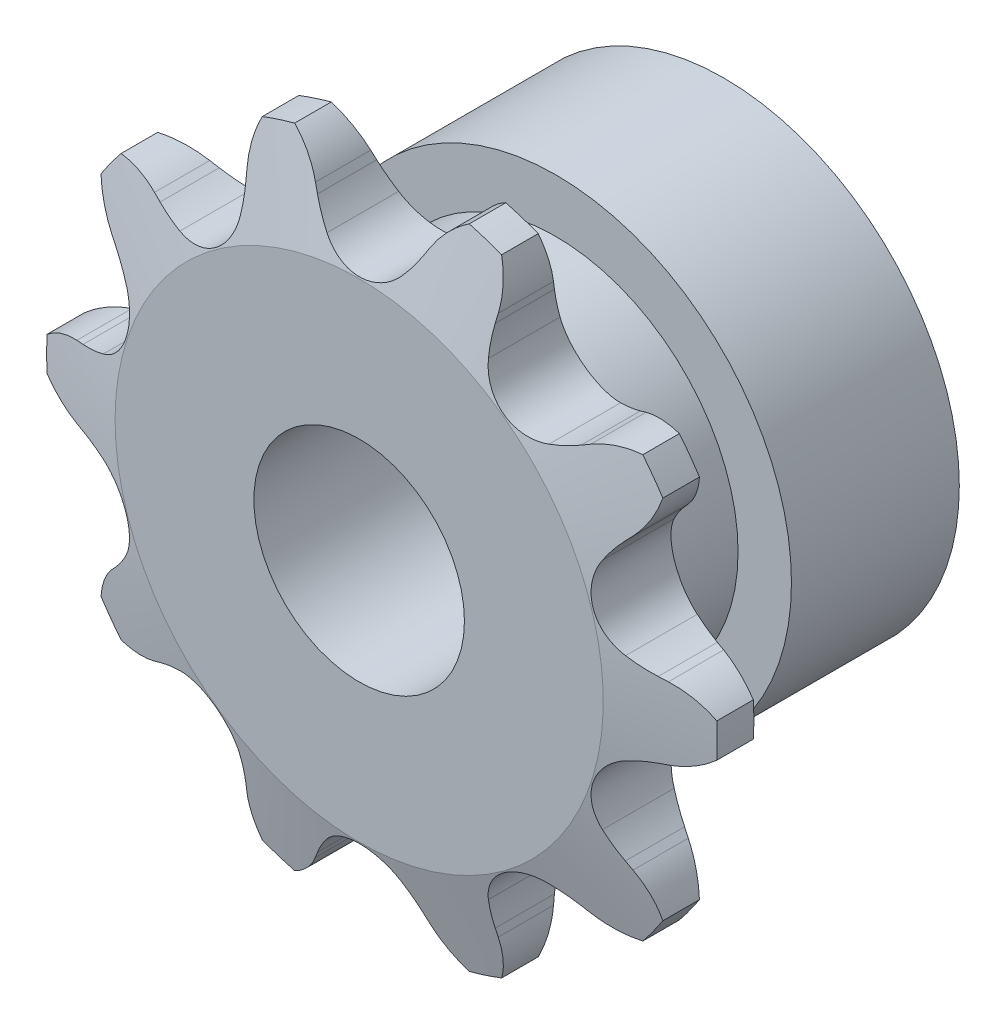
from build123d import *

# Parameters (mm, degrees)
TOOTH_CUT_NUMBER_OF_TEETH_10_DEPTH = 25.862719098
TOOTH_PATTERN_10_10_COUNT          = 10
CUT_EXTRUDE1_DEPTH                 = 30.639540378
CUT_EXTRUDE1_DEPTH_BACK            = 30.639540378
SKETCH4_R                          = 4.7625
SKETCH6_R                          = 5.5
CUT_EXTRUDE2_DEPTH                 = 31.91390917


with BuildPart() as part:
    # Sprocket-BaseSketch → 35 _06C_ ANSI _ISO_ Chain Number_ 1.214i (revolve)
    with BuildSketch(Plane(origin=(0, 0, 0), x_dir=(0, 0, -1), z_dir=(1, 0, 0)), mode=Mode.PRIVATE) as f_35_06c_ansi_iso_chain_number_1_214i_sk:
        Polygon((2.1463, 0), (2.1463, 12.752467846), (0.955675, 17.514967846), (-0.955675, 17.514967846), (-2.1463, 12.752467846), (-2.1463, 0), align=None)
    revolve(f_35_06c_ansi_iso_chain_number_1_214i_sk.sketch.rotate(Axis((0, 0, -8.5852), (0, 0, 1)), 90), axis=Axis((0, 0, -8.5852), (0, 0, 1)))

    # Tooth-Sketch → Tooth-Cut_ Number of teeth_ 10 (cut, symmetric)
    with BuildSketch(Plane.XY):
        with BuildLine():
            Line((2.775661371, 14.89239906), (2.984168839, 15.274828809))
            ThreePointArc((2.984168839, 15.274828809), (4.56601017, 16.915736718), (6.763913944, 17.519077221))
            ThreePointArc((6.763913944, 17.519077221), (0, 18.779472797), (-6.763913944, 17.519077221))
            ThreePointArc((-6.763913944, 17.519077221), (-4.56601017, 16.915736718), (-2.984168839, 15.274828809))
            Line((-2.984168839, 15.274828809), (-2.775661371, 14.89239906))
            ThreePointArc((-2.775661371, 14.89239906), (-2.397444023, 14.280012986), (-1.95530158, 13.712056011))
            ThreePointArc((-1.95530158, 13.712056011), (0, 12.820973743), (1.95530158, 13.712056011))
            ThreePointArc((1.95530158, 13.712056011), (2.397444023, 14.280012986), (2.775661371, 14.89239906))
        make_face()
    tooth_cut_number_of_teeth_10 = extrude(amount=TOOTH_CUT_NUMBER_OF_TEETH_10_DEPTH, both=True, mode=Mode.SUBTRACT)

    # Tooth Pattern_ 10 _ 10: Tooth-Cut_ Number of teeth_ 10 ×10 about axis
    tooth_pattern_10_10_axis = Axis((0, 0, 0), (0, 0, 1))
    for i in range(1, TOOTH_PATTERN_10_10_COUNT):
        add(tooth_cut_number_of_teeth_10.rotate(tooth_pattern_10_10_axis, i * 360 / TOOTH_PATTERN_10_10_COUNT), mode=Mode.SUBTRACT)

    # Sketch3 → Hub-Revolve1 (revolve)
    with BuildSketch(Plane(origin=(0, 0, 0), x_dir=(0, 0, -1), z_dir=(1, 0, 0)), mode=Mode.PRIVATE) as hub_revolve1_sk:
        Polygon((2.1463, 0), (2.1463, 9.513967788), (8.134350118, 9.513967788), (8.134350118, 12.303760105), (16.9037, 12.303760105), (16.9037, 0), align=None)
    revolve(hub_revolve1_sk.sketch.rotate(Axis((0, 0, 14.7574), (0, 0, -1)), 90), axis=Axis((0, 0, 14.7574), (0, 0, -1)))

    # Sketch4 → Cut-Extrude1 (cut, two sides: drawn at the far end of the back side and taken through both)
    with BuildSketch(Plane.XY.offset(-CUT_EXTRUDE1_DEPTH_BACK)):
        Circle(SKETCH4_R)
    extrude(amount=CUT_EXTRUDE1_DEPTH + CUT_EXTRUDE1_DEPTH_BACK, mode=Mode.SUBTRACT)

    # Sketch6 → Cut-Extrude2 (cut, through all)
    with BuildSketch(Plane.XY.offset(2.1463)):
        Circle(SKETCH6_R)
    extrude(amount=-CUT_EXTRUDE2_DEPTH, mode=Mode.SUBTRACT)


solid = part.part
